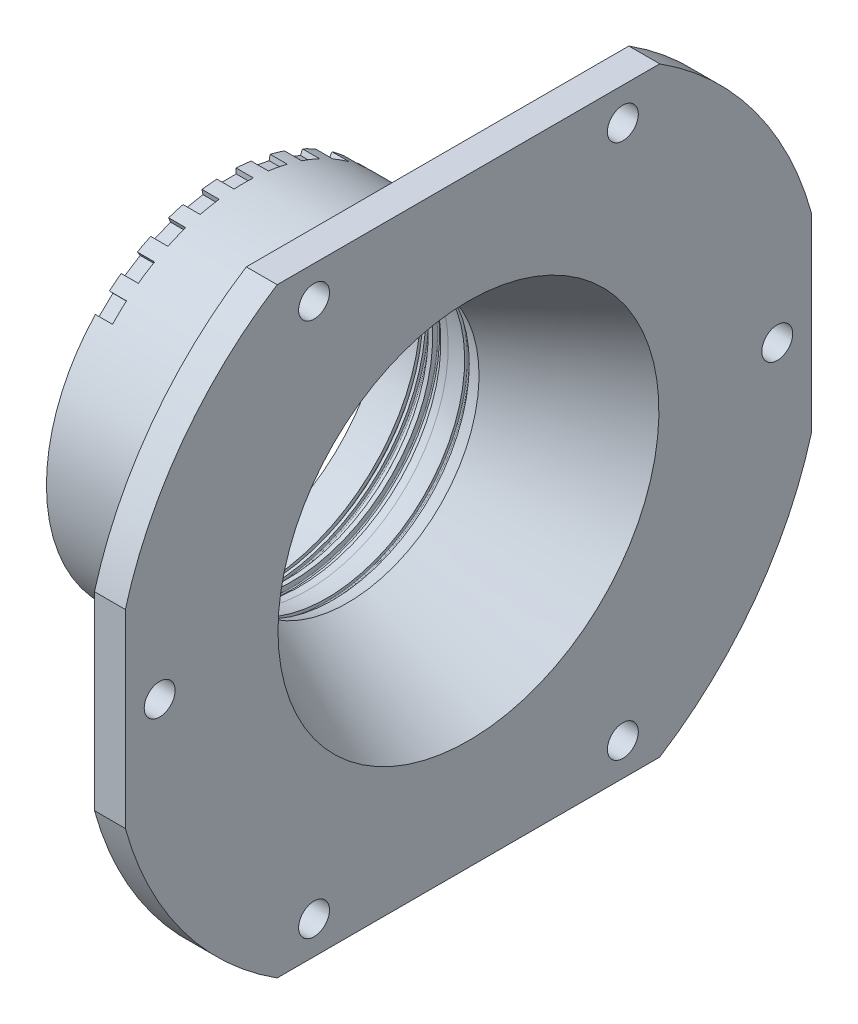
from build123d import *

# Parameters (mm, degrees)
ESQUISSE3_OUTSIDE_W          = 537.72
ESQUISSE3_OUTSIDE_H          = 537.72
ESQUISSE3_OUTSIDE_W_2        = 400
ESQUISSE3_OUTSIDE_H_2        = 350
EXTRUSION1_DEPTH             = 84
ESQUISSE4_R                  = 9
EXTRUSION2_DEPTH             = 84
EXTRUSION3_DEPTH             = 10
R_P_TITION_CIRCULAIRE1_COUNT = 9
R_P_TITION_CIRCULAIRE1_ANGLE = 87.328


with BuildPart() as part:
    # Esquisse1 → R_volution1 (revolve)
    with BuildSketch(Plane.XY, mode=Mode.PRIVATE) as r_volution1_sk:
        with BuildLine():
            Line((20.4, 95), (23.4, 95))
            Line((23.4, 95), (23.4, 91))
            Line((23.4, 91), (25.1, 91))
            Line((25.1, 91), (25.1, 92.7))
            ThreePointArc((25.1, 92.7), (25.275735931, 93.124264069), (25.7, 93.3))
            Line((25.7, 93.3), (28.4, 93.3))
            ThreePointArc((28.4, 93.3), (28.824264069, 93.124264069), (29, 92.7))
            Line((29, 92.7), (29, 91))
            Line((29, 91), (35, 91))
            Line((35, 91), (35, 82.55))
            Line((35, 82.55), (37.6, 82.55))
            Line((37.6, 82.55), (37.6, 85.4))
            ThreePointArc((37.6, 85.4), (37.775735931, 85.824264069), (38.2, 86))
            Line((38.2, 86), (41.8, 86))
            ThreePointArc((41.8, 86), (42.224264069, 85.824264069), (42.4, 85.4))
            Line((42.4, 85.4), (42.4, 82.55))
            Line((42.4, 82.55), (47, 82.55))
            Line((47, 82.55), (47, 82.202493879))
            ThreePointArc((47, 82.202493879), (52.710895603, 81.514925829), (58.36, 80.431091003))
            Line((58.36, 80.431091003), (58.36, 82))
            ThreePointArc((58.36, 82), (58.535735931, 82.424264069), (58.96, 82.6))
            Line((58.96, 82.6), (61.36, 82.6))
            ThreePointArc((61.36, 82.6), (61.784264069, 82.424264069), (61.96, 82))
            Line((61.96, 82), (61.96, 79.523634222))
            ThreePointArc((61.96, 79.523634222), (66.279387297, 78.20258182), (70.52, 76.647110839))
            Line((70.52, 76.647110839), (141, 111.022503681))
            Line((141, 111.022503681), (141, 207.5))
            Line((141, 207.5), (123, 207.5))
            Line((123, 207.5), (123, 120.607442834))
            Line((123, 120.607442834), (91, 105))
            Line((91, 105), (0, 105))
            Line((0, 105), (0, 92.75))
            Line((0, 92.75), (20.4, 92.75))
            Line((20.4, 92.75), (20.4, 95))
        make_face()
    revolve(r_volution1_sk.sketch.rotate(Axis((-14.758998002, 0, 0), (1, 0, 0)), 90), axis=Axis((-14.758998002, 0, 0), (1, 0, 0)))

    # Esquisse3 outside → Extrusion1 (cut)
    with BuildSketch(Plane.ZY.offset(-123)):
        Rectangle(ESQUISSE3_OUTSIDE_W, ESQUISSE3_OUTSIDE_H)
        Rectangle(ESQUISSE3_OUTSIDE_W_2, ESQUISSE3_OUTSIDE_H_2, mode=Mode.SUBTRACT)
    extrude(amount=-EXTRUSION1_DEPTH, mode=Mode.SUBTRACT)

    # Esquisse4 → Extrusion2 (cut)
    with BuildSketch(Plane.ZY.offset(-123)):
        with Locations((-90, 155.884572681)):
            Circle(ESQUISSE4_R)
        with Locations((90, 155.884572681)):
            Circle(ESQUISSE4_R)
        with Locations((180, 0)):
            Circle(ESQUISSE4_R)
        with Locations((90, -155.884572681)):
            Circle(ESQUISSE4_R)
        with Locations((-90, -155.884572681)):
            Circle(ESQUISSE4_R)
        with Locations((-180, 0)):
            Circle(ESQUISSE4_R)
    extrude(amount=-EXTRUSION2_DEPTH, mode=Mode.SUBTRACT)

    # Esquisse5 → Extrusion3 (cut)
    with BuildSketch(Plane.ZY):
        Polygon((-66.249172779, 77.562570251), (-74.389818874, 69.792979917), (-132.975977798, 131.177063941), (-124.835331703, 138.946654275), align=None)
    extrusion3 = extrude(amount=-EXTRUSION3_DEPTH, mode=Mode.SUBTRACT)

    # R_p_tition circulaire1: Extrusion3 ×9 about axis
    r_p_tition_circulaire1_axis = Axis((0, 0, 0), (1, 0, 0))
    for i in range(1, R_P_TITION_CIRCULAIRE1_COUNT):
        add(extrusion3.rotate(r_p_tition_circulaire1_axis, i * R_P_TITION_CIRCULAIRE1_ANGLE / (R_P_TITION_CIRCULAIRE1_COUNT - 1)), mode=Mode.SUBTRACT)


solid = part.part
